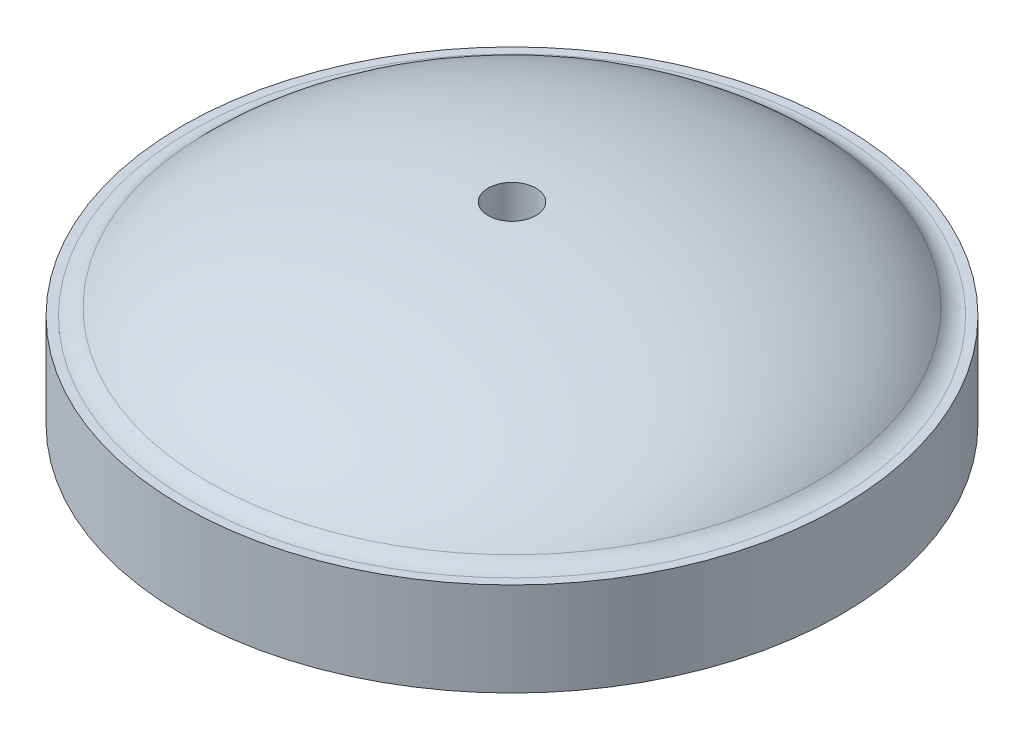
from build123d import *

# Parameters (mm, degrees)
RIBS_EXTRUDE_REACH = 130.503
CIRPATTERN1_COUNT  = 5
SKETCH6_R          = 6.35
CUT_EXTRUDE1_DEPTH = 129.503195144


with BuildPart() as part:
    # Sketch2 → Base-Revolve (revolve)
    with BuildSketch(Plane.XY, mode=Mode.PRIVATE) as base_revolve_sk:
        with BuildLine():
            Line((13.335, 35.469106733), (13.335, 5.9944))
            Line((13.335, 5.9944), (3.556, 5.9944))
            Line((3.556, 5.9944), (2.754051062, 39.980240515))
            add(Edge.make_bspline(
                [(80.655188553, 15.638545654), (58.751429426, 39.176513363), (2.754051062, 39.980240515)],
                knots=[0.401678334, 0.401678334, 0.401678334, 1.539362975, 1.539362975, 1.539362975], degree=2, weights=[1, 0.842525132, 1]))
            ThreePointArc((80.655188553, 15.638545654), (82.768702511, 14.142386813), (85.303788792, 13.6144))
            Line((85.303788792, 13.6144), (87.63, 13.6144))
            Line((87.63, 13.6144), (87.63, -11.2776))
            Line((87.63, -11.2776), (82.55, -11.2776))
            Line((82.55, -11.2776), (82.55, 5.9944))
            Line((82.55, 5.9944), (71.5, 5.9944))
            Line((71.5, 5.9944), (71.5, 11.259834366))
            ThreePointArc((71.5, 11.259834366), (69.712620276, 17.756350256), (64.853587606, 22.424245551))
            add(Edge.make_bspline(
                [(64.853587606, 22.424245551), (44.898525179, 33.244316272), (13.335, 35.469106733)],
                knots=[0.673857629, 0.673857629, 0.673857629, 1.409423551, 1.409423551, 1.409423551], degree=2, weights=[1, 0.933126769, 1]))
        make_face()
    revolve(base_revolve_sk.sketch.rotate(Axis((0, 86.36, 0), (0, -1, 0)), 90), axis=Axis((0, 86.36, 0), (0, -1, 0)))

    # Sketch3 → Ribs Extrude (add, up to next)
    with BuildSketch(Plane.XZ.offset(-5.9944), mode=Mode.PRIVATE) as ribs_extrude_sk1:
        with BuildLine():
            Line((-47.378108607, 53.549648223), (-5.249445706, 12.25828474))
            ThreePointArc((-5.249445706, 12.25828474), (-9.523432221, 9.334155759), (-12.361183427, 5.002336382))
            Line((-12.361183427, 5.002336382), (-54.489846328, 46.293699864))
            ThreePointArc((-54.489846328, 46.293699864), (-51.063022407, 50.048154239), (-47.378108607, 53.549648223))
        make_face()
    ribs_extrude_tool1 = extrude(ribs_extrude_sk1.sketch, amount=-RIBS_EXTRUDE_REACH, mode=Mode.PRIVATE) - part.part
    ribs_extrude = ribs_extrude_tool1.solids().sort_by_distance((-30.153385, 5.9944, 29.554092))[0]
    add(ribs_extrude)

    # CirPattern1: Ribs Extrude ×5 about axis
    cirpattern1_axis = Axis((0, 0, 0), (0, 1, 0))
    for i in range(1, CIRPATTERN1_COUNT):
        add(ribs_extrude.rotate(cirpattern1_axis, i * 360 / CIRPATTERN1_COUNT))

    # Sketch6 → Cut-Extrude1 (cut, through all)
    with BuildSketch(Plane.XZ.offset(-5.9944)):
        with Locations(Location((0, 0, 0), (0, 0, 270))):
            Circle(SKETCH6_R)
    extrude(amount=-CUT_EXTRUDE1_DEPTH, mode=Mode.SUBTRACT)


solid = part.part
